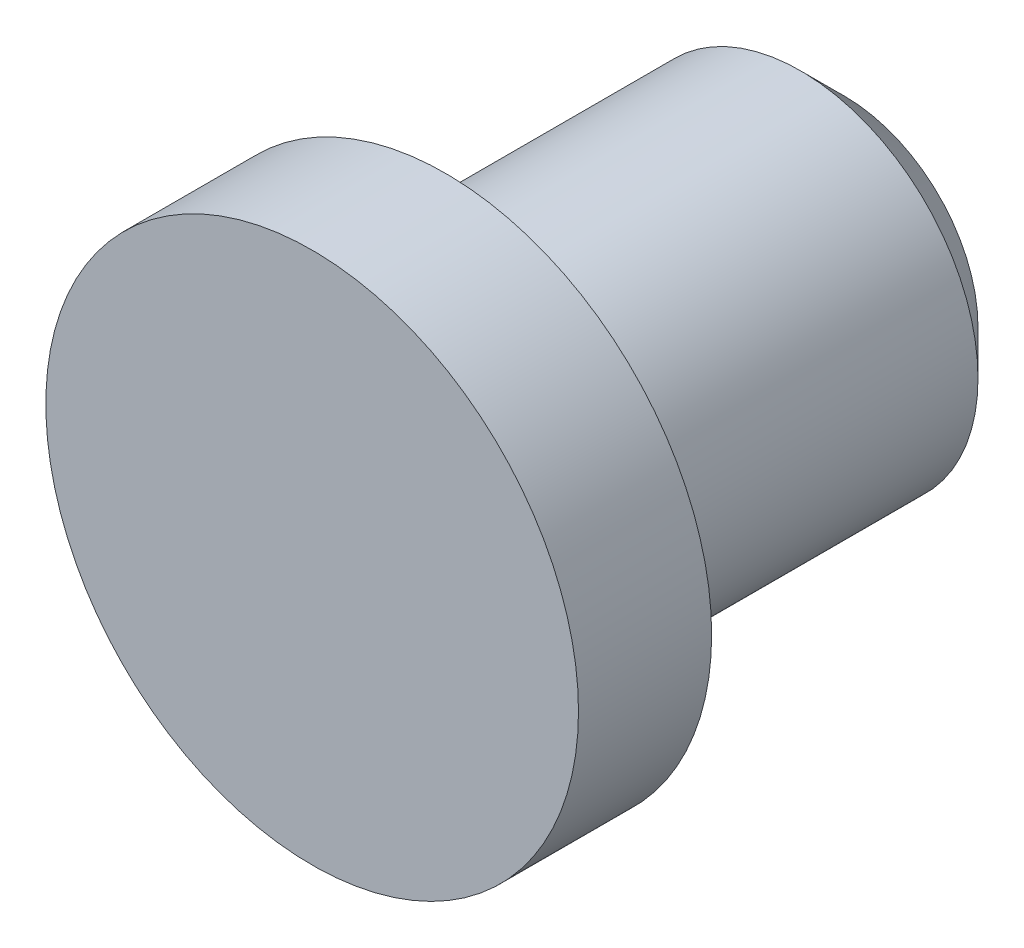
ISO-10303-21;
HEADER;
FILE_DESCRIPTION(('STEP AP214'),'2;1');
FILE_NAME('part.step','',(''),(''),'','','');
FILE_SCHEMA(('AUTOMOTIVE_DESIGN { 1 0 10303 214 1 1 1 1 }'));
ENDSEC;
DATA;
#1=APPLICATION_CONTEXT('core data for automotive mechanical design processes');
#2=APPLICATION_PROTOCOL_DEFINITION('international standard','automotive_design',2000,#1);
#3=PRODUCT_CONTEXT('',#1,'mechanical');
#4=PRODUCT('Part','Part','',(#3));
#5=PRODUCT_RELATED_PRODUCT_CATEGORY('part','',(#4));
#6=PRODUCT_DEFINITION_FORMATION('','',#4);
#7=PRODUCT_DEFINITION_CONTEXT('part definition',#1,'design');
#8=PRODUCT_DEFINITION('design','',#6,#7);
#9=PRODUCT_DEFINITION_SHAPE('','',#8);
#10=(LENGTH_UNIT() NAMED_UNIT(*) SI_UNIT(.MILLI.,.METRE.));
#11=(NAMED_UNIT(*) PLANE_ANGLE_UNIT() SI_UNIT($,.RADIAN.));
#12=(NAMED_UNIT(*) SI_UNIT($,.STERADIAN.) SOLID_ANGLE_UNIT());
#13=UNCERTAINTY_MEASURE_WITH_UNIT(LENGTH_MEASURE(1.E-05),#10,'distance_accuracy_value','');
#14=(GEOMETRIC_REPRESENTATION_CONTEXT(3) GLOBAL_UNCERTAINTY_ASSIGNED_CONTEXT((#13)) GLOBAL_UNIT_ASSIGNED_CONTEXT((#10,
#11,#12)) REPRESENTATION_CONTEXT('',''));
#15=CARTESIAN_POINT('',(0.,0.,0.));
#16=DIRECTION('',(0.,0.,1.));
#17=DIRECTION('',(1.,0.,0.));
#18=AXIS2_PLACEMENT_3D('',#15,#16,#17);
#19=CARTESIAN_POINT('',(0.,0.,9.));
#20=DIRECTION('',(0.,0.,-1.));
#21=DIRECTION('',(-1.,0.,0.));
#22=AXIS2_PLACEMENT_3D('',#19,#20,#21);
#23=CYLINDRICAL_SURFACE('',#22,4.);
#24=CARTESIAN_POINT('',(0.,0.,0.999999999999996));
#25=DIRECTION('',(0.,0.,1.));
#26=DIRECTION('',(1.,0.,0.));
#27=AXIS2_PLACEMENT_3D('',#24,#25,#26);
#28=CIRCLE('',#27,4.);
#29=CARTESIAN_POINT('',(4.,0.,0.999999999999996));
#30=VERTEX_POINT('',#29);
#31=EDGE_CURVE('E44',#30,#30,#28,.T.);
#32=ORIENTED_EDGE('',*,*,#31,.T.);
#33=EDGE_LOOP('',(#32));
#34=FACE_BOUND('',#33,.T.);
#35=CARTESIAN_POINT('',(0.,0.,9.));
#36=DIRECTION('',(0.,0.,1.));
#37=DIRECTION('',(1.,0.,0.));
#38=AXIS2_PLACEMENT_3D('',#35,#36,#37);
#39=CIRCLE('',#38,4.);
#40=CARTESIAN_POINT('',(4.,0.,9.));
#41=VERTEX_POINT('',#40);
#42=EDGE_CURVE('E48',#41,#41,#39,.T.);
#43=ORIENTED_EDGE('',*,*,#42,.F.);
#44=EDGE_LOOP('',(#43));
#45=FACE_BOUND('',#44,.T.);
#46=ADVANCED_FACE('F36',(#34,#45),#23,.T.);
#47=CARTESIAN_POINT('',(0.,0.,0.));
#48=DIRECTION('',(0.,0.,1.));
#49=DIRECTION('',(1.,0.,0.));
#50=AXIS2_PLACEMENT_3D('',#47,#48,#49);
#51=PLANE('',#50);
#52=CARTESIAN_POINT('',(0.,0.,0.));
#53=DIRECTION('',(0.,0.,1.));
#54=DIRECTION('',(1.,0.,0.));
#55=AXIS2_PLACEMENT_3D('',#52,#53,#54);
#56=CIRCLE('',#55,3.);
#57=CARTESIAN_POINT('',(3.,0.,0.));
#58=VERTEX_POINT('',#57);
#59=EDGE_CURVE('E10',#58,#58,#56,.F.);
#60=ORIENTED_EDGE('',*,*,#59,.T.);
#61=EDGE_LOOP('',(#60));
#62=FACE_BOUND('',#61,.T.);
#63=ADVANCED_FACE('F66',(#62),#51,.F.);
#64=CARTESIAN_POINT('',(0.,0.,12.));
#65=DIRECTION('',(0.,0.,-1.));
#66=DIRECTION('',(-1.,0.,0.));
#67=AXIS2_PLACEMENT_3D('',#64,#65,#66);
#68=CYLINDRICAL_SURFACE('',#67,6.);
#69=CARTESIAN_POINT('',(0.,0.,12.));
#70=DIRECTION('',(0.,0.,1.));
#71=DIRECTION('',(1.,0.,0.));
#72=AXIS2_PLACEMENT_3D('',#69,#70,#71);
#73=CIRCLE('',#72,6.);
#74=CARTESIAN_POINT('',(6.,0.,12.));
#75=VERTEX_POINT('',#74);
#76=EDGE_CURVE('E52',#75,#75,#73,.T.);
#77=ORIENTED_EDGE('',*,*,#76,.F.);
#78=EDGE_LOOP('',(#77));
#79=FACE_BOUND('',#78,.T.);
#80=CARTESIAN_POINT('',(0.,0.,9.));
#81=DIRECTION('',(0.,0.,1.));
#82=DIRECTION('',(1.,0.,0.));
#83=AXIS2_PLACEMENT_3D('',#80,#81,#82);
#84=CIRCLE('',#83,6.);
#85=CARTESIAN_POINT('',(6.,0.,9.));
#86=VERTEX_POINT('',#85);
#87=EDGE_CURVE('E55',#86,#86,#84,.T.);
#88=ORIENTED_EDGE('',*,*,#87,.T.);
#89=EDGE_LOOP('',(#88));
#90=FACE_BOUND('',#89,.T.);
#91=ADVANCED_FACE('F63',(#79,#90),#68,.T.);
#92=CARTESIAN_POINT('',(0.,0.,12.));
#93=DIRECTION('',(0.,0.,1.));
#94=DIRECTION('',(1.,0.,0.));
#95=AXIS2_PLACEMENT_3D('',#92,#93,#94);
#96=PLANE('',#95);
#97=ORIENTED_EDGE('',*,*,#76,.T.);
#98=EDGE_LOOP('',(#97));
#99=FACE_BOUND('',#98,.T.);
#100=ADVANCED_FACE('F61',(#99),#96,.T.);
#101=CARTESIAN_POINT('',(0.,0.,9.));
#102=DIRECTION('',(0.,0.,1.));
#103=DIRECTION('',(1.,0.,0.));
#104=AXIS2_PLACEMENT_3D('',#101,#102,#103);
#105=PLANE('',#104);
#106=ORIENTED_EDGE('',*,*,#42,.T.);
#107=EDGE_LOOP('',(#106));
#108=FACE_BOUND('',#107,.T.);
#109=ORIENTED_EDGE('',*,*,#87,.F.);
#110=EDGE_LOOP('',(#109));
#111=FACE_BOUND('',#110,.T.);
#112=ADVANCED_FACE('F70',(#108,#111),#105,.F.);
#113=CARTESIAN_POINT('',(0.,0.,0.999999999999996));
#114=DIRECTION('',(0.,0.,1.));
#115=DIRECTION('',(1.,0.,0.));
#116=AXIS2_PLACEMENT_3D('',#113,#114,#115);
#117=CONICAL_SURFACE('',#116,4.,0.785398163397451);
#118=ORIENTED_EDGE('',*,*,#59,.F.);
#119=EDGE_LOOP('',(#118));
#120=FACE_BOUND('',#119,.T.);
#121=ORIENTED_EDGE('',*,*,#31,.F.);
#122=EDGE_LOOP('',(#121));
#123=FACE_BOUND('',#122,.T.);
#124=ADVANCED_FACE('F39',(#120,#123),#117,.T.);
#125=CLOSED_SHELL('',(#46,#63,#91,#100,#112,#124));
#126=MANIFOLD_SOLID_BREP('B2',#125);
#127=ADVANCED_BREP_SHAPE_REPRESENTATION('',(#18,#126),#14);
#128=SHAPE_DEFINITION_REPRESENTATION(#9,#127);
ENDSEC;
END-ISO-10303-21;
